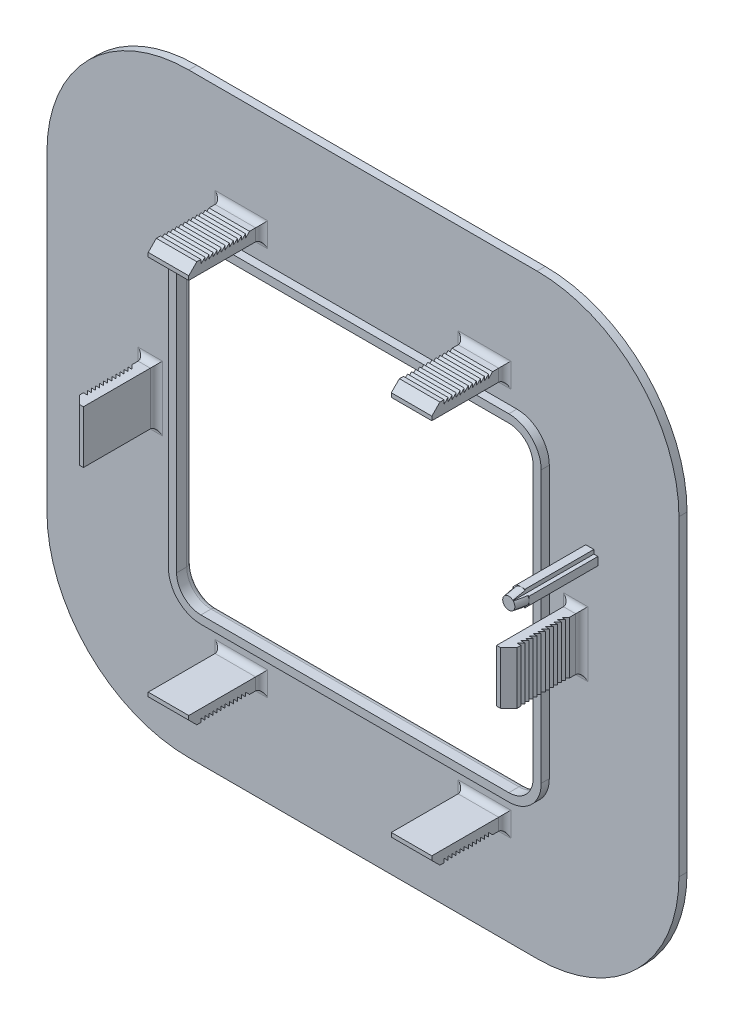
from build123d import *

# Parameters (mm, degrees)
BOSS_EXTRUDE1_DEPTH     = 2
BOSS_EXTRUDE2_DEPTH     = 4
FILLET1_R               = 1.5
BOSS_EXTRUDE3_DEPTH     = 20
SKETCH4_W               = 10
SKETCH4_H               = 3
BOSS_EXTRUDE4_DEPTH     = 18
CUT_EXTRUDE1_DEPTH      = 18
CUT_EXTRUDE2_DEPTH      = 195.532773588
CUT_EXTRUDE2_DEPTH_BACK = 195.532773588
CUT_EXTRUDE3_DEPTH      = 272.604491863
CUT_EXTRUDE3_DEPTH_BACK = 272.604491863
CUT_EXTRUDE4_DEPTH      = 18
FILLET2_R               = 1.5


with BuildPart() as part:
    # Sketch1 → Boss-Extrude1 (new body)
    with BuildSketch(Plane.XY):
        with BuildLine():
            Line((35, 147), (121, 147))
            ThreePointArc((121, 147), (145.748737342, 136.748737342), (156, 112))
            Line((156, 112), (156, 35))
            ThreePointArc((156, 35), (145.748737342, 10.251262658), (121, 0))
            Line((121, 0), (35, 0))
            ThreePointArc((35, 0), (10.251262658, 10.251262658), (0, 35))
            Line((0, 35), (0, 112))
            ThreePointArc((0, 112), (10.251262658, 136.748737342), (35, 147))
        make_face()
        with BuildLine():
            ThreePointArc((116, 32), (121.656854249, 34.343145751), (124, 40))
            Line((124, 40), (124, 107))
            ThreePointArc((124, 107), (121.656854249, 112.656854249), (116, 115))
            Line((116, 115), (40, 115))
            ThreePointArc((40, 115), (34.343145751, 112.656854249), (32, 107))
            Line((32, 107), (32, 40))
            ThreePointArc((32, 40), (34.343145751, 34.343145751), (40, 32))
            Line((40, 32), (116, 32))
        make_face(mode=Mode.SUBTRACT)
    extrude(amount=BOSS_EXTRUDE1_DEPTH)

    # Sketch1_3 → Boss-Extrude2 (add)
    with BuildSketch(Plane.XY):
        with BuildLine():
            Line((40, 32), (116, 32))
            ThreePointArc((116, 32), (121.656854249, 34.343145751), (124, 40))
            Line((124, 40), (124, 107))
            ThreePointArc((124, 107), (121.656854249, 112.656854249), (116, 115))
            Line((116, 115), (40, 115))
            ThreePointArc((40, 115), (34.343145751, 112.656854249), (32, 107))
            Line((32, 107), (32, 40))
            ThreePointArc((32, 40), (34.343145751, 34.343145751), (40, 32))
        make_face()
        with BuildLine():
            ThreePointArc((40, 113), (35.757359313, 111.242640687), (34, 107))
            Line((34, 107), (34, 40))
            ThreePointArc((34, 40), (35.757359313, 35.757359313), (40, 34))
            Line((40, 34), (116, 34))
            ThreePointArc((116, 34), (120.242640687, 35.757359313), (122, 40))
            Line((122, 40), (122, 107))
            ThreePointArc((122, 107), (120.242640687, 111.242640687), (116, 113))
            Line((116, 113), (40, 113))
        make_face(mode=Mode.SUBTRACT)
    extrude(amount=BOSS_EXTRUDE2_DEPTH)

    # Fillet1
    fillet1_edges = [part.edges().sort_by_distance(p)[0] for p in [
        (78, 113, 0),
        (34, 73.5, 0),
        (35.757359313, 111.242640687, 0),
        (35.757359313, 35.757359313, 0),
        (78, 34, 0),
        (120.242640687, 35.757359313, 0),
        (122, 73.5, 0),
        (120.242640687, 111.242640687, 0),
    ]]
    fillet(fillet1_edges, radius=FILLET1_R)

    # Sketch2 → Boss-Extrude3 (add)
    with BuildSketch(Plane.XY.offset(2)):
        Polygon((134, 94.5), (133, 94.5), (133, 93.5), (132, 93.5), (132, 91.5), (133, 91.5), (133, 90.5), (135, 90.5), (135, 91.5), (136, 91.5), (136, 93.5), (135, 93.5), (135, 94.5), align=None)
    extrude(amount=BOSS_EXTRUDE3_DEPTH)

    # Sketch3 → Cut-Revolve2 (revolve, cut)
    with BuildSketch(Plane.ZY.offset(-134)):
        Polygon((22, 92.5), (22.5, 92.5), (22.5, 95.5), (19, 95.5), (19, 94.5), (22, 94), align=None)
    revolve(axis=Axis((134, 92.5, 22), (0, 0, -1)), mode=Mode.SUBTRACT)

    # Sketch4 → Boss-Extrude4 (add)
    with BuildSketch(Plane.XY.offset(2)):
        Polygon((129, 73.5), (129, 80), (132, 80), (132, 67), (129, 67), align=None)
        Polygon((27, 67), (27, 73.5), (27, 80), (24, 80), (24, 67), align=None)
        with Locations((48, 121.5)):
            Rectangle(SKETCH4_W, SKETCH4_H)
        with Locations((108, 121.5)):
            Rectangle(SKETCH4_W, SKETCH4_H)
        with Locations((108, 25.5)):
            Rectangle(SKETCH4_W, SKETCH4_H)
        with Locations((48, 25.5)):
            Rectangle(SKETCH4_W, SKETCH4_H)
    extrude(amount=BOSS_EXTRUDE4_DEPTH)

    # Sketch5 → Cut-Extrude1 (cut)
    with BuildSketch(Plane.XZ.offset(-67)):
        Polygon((26, 20), (24, 18), (24, 17), (25, 17), (24, 16), (25, 16), (24, 15), (25, 15), (24, 14), (25, 14), (24, 13), (25, 13), (24, 12), (25, 12), (24, 11), (25, 11), (24, 10), (25, 10), (24, 9), (25, 9), (24, 8), (25, 8), (24, 7), (25, 7), (24, 6), (25, 6), (24, 5), (23.152608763, 5), (23.152608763, 20.812701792), (26, 20.812701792), align=None)
    extrude(amount=-CUT_EXTRUDE1_DEPTH, mode=Mode.SUBTRACT)

    # Sketch6 → Cut-Extrude2 (cut, two sides: drawn at the far end of the back side and taken through both)
    with BuildSketch(Plane(origin=(53, 0, -53), x_dir=(0, 0, -1), z_dir=(-1, 0, 0)).offset(-CUT_EXTRUDE2_DEPTH_BACK)):
        Polygon((-58, -23.152608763), (-58, -24), (-59, -25), (-59, -24), (-60, -25), (-60, -24), (-61, -25), (-61, -24), (-62, -25), (-62, -24), (-63, -25), (-63, -24), (-64, -25), (-64, -24), (-65, -25), (-65, -24), (-66, -25), (-66, -24), (-67, -25), (-67, -24), (-68, -25), (-68, -24), (-69, -25), (-69, -24), (-70, -25), (-70, -24), (-71, -24), (-73, -26), (-73.812701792, -26), (-73.812701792, -23.152608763), align=None)
    extrude(amount=CUT_EXTRUDE2_DEPTH + CUT_EXTRUDE2_DEPTH_BACK, mode=Mode.SUBTRACT)

    # Sketch7 → Cut-Extrude3 (cut, two sides: drawn at the far end of the back side and taken through both)
    with BuildSketch(Plane(origin=(113, -99, 0), x_dir=(0, -1, 0), z_dir=(-1, 0, 0)).offset(-CUT_EXTRUDE3_DEPTH_BACK)):
        Polygon((-220, 20), (-222, 18), (-222, 17), (-221, 17), (-222, 16), (-221, 16), (-222, 15), (-221, 15), (-222, 14), (-221, 14), (-222, 13), (-221, 13), (-222, 12), (-221, 12), (-222, 11), (-221, 11), (-222, 10), (-221, 10), (-222, 9), (-221, 9), (-222, 8), (-221, 8), (-222, 7), (-221, 7), (-222, 6), (-221, 6), (-222, 5), (-222.847391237, 5), (-222.847391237, 20.812701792), (-220, 20.812701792), align=None)
    extrude(amount=CUT_EXTRUDE3_DEPTH + CUT_EXTRUDE3_DEPTH_BACK, mode=Mode.SUBTRACT)

    # Sketch8 → Cut-Extrude4 (cut)
    with BuildSketch(Plane(origin=(0, 67, -67), x_dir=(-1, 0, 0), z_dir=(0, -1, 0))):
        Polygon((-132.847391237, -72), (-132, -72), (-131, -73), (-132, -73), (-131, -74), (-132, -74), (-131, -75), (-132, -75), (-131, -76), (-132, -76), (-131, -77), (-132, -77), (-131, -78), (-132, -78), (-131, -79), (-132, -79), (-131, -80), (-132, -80), (-131, -81), (-132, -81), (-131, -82), (-132, -82), (-131, -83), (-132, -83), (-131, -84), (-132, -84), (-132, -85), (-130, -87), (-130, -87.812701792), (-132.847391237, -87.812701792), align=None)
    extrude(amount=-CUT_EXTRUDE4_DEPTH, mode=Mode.SUBTRACT)

    # Fillet2
    fillet2_edges = [part.edges().sort_by_distance(p)[0] for p in [
        (130.5, 67, 2),
        (132, 73.5, 2),
        (130.5, 80, 2),
        (129, 73.5, 2),
        (25.5, 67, 2),
        (27, 73.5, 2),
        (25.5, 80, 2),
        (24, 73.5, 2),
        (48, 120, 2),
        (53, 121.5, 2),
        (48, 123, 2),
        (43, 121.5, 2),
        (108, 120, 2),
        (113, 121.5, 2),
        (108, 123, 2),
        (103, 121.5, 2),
        (113, 25.5, 2),
        (108, 27, 2),
        (103, 25.5, 2),
        (108, 24, 2),
        (48, 27, 2),
        (43, 25.5, 2),
        (48, 24, 2),
        (53, 25.5, 2),
    ]]
    fillet(fillet2_edges, radius=FILLET2_R)


solid = part.part
